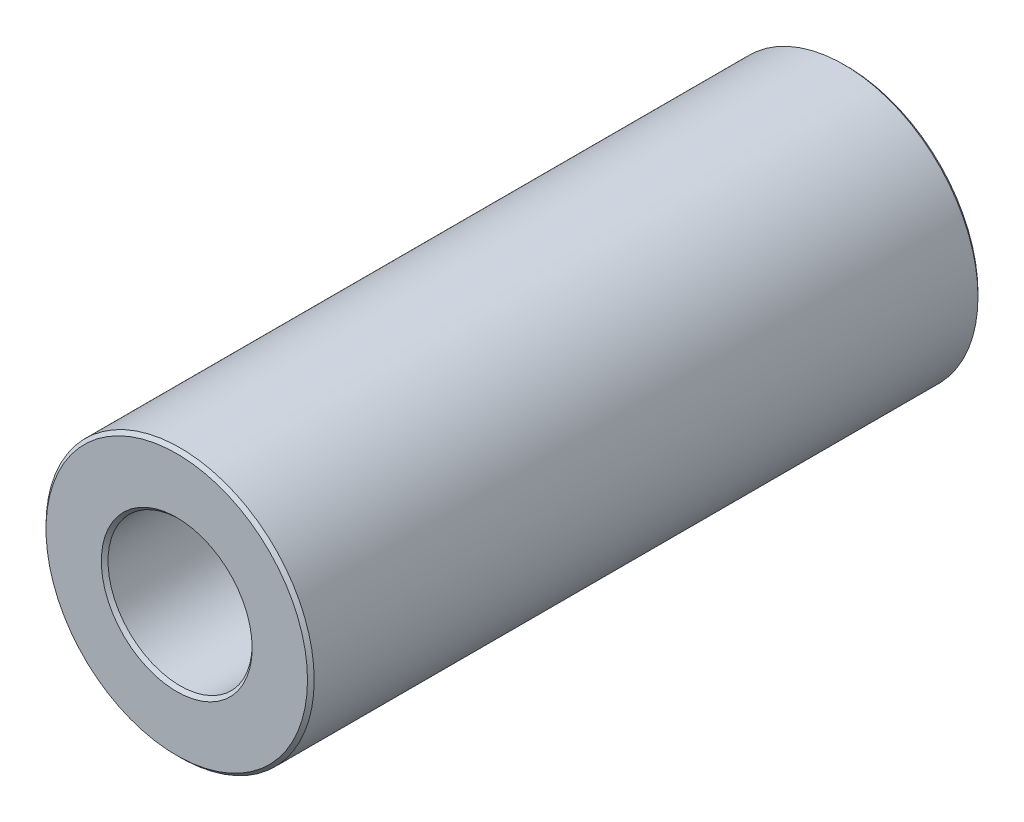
from build123d import *

# Parameters (mm, degrees)
SKETCH1_R           = 4
SKETCH1_R_2         = 2.15
BOSS_EXTRUDE2_DEPTH = 10
CHAMFER3_SIZE       = 0.1


with BuildPart() as part:
    # Sketch1 → Boss-Extrude2 (new, symmetric)
    with BuildSketch(Plane.XY):
        Circle(SKETCH1_R)
        Circle(SKETCH1_R_2, mode=Mode.SUBTRACT)
    extrude(amount=BOSS_EXTRUDE2_DEPTH, both=True)

    # Chamfer3
    chamfer3_edges = [part.edges().sort_by_distance(p)[0] for p in [
        (-4, 0, -10),
        (-4, 0, 10),
        (-2.15, 0, -10),
        (-2.15, 0, 10),
    ]]
    chamfer(chamfer3_edges, length=CHAMFER3_SIZE)


solid = part.part
